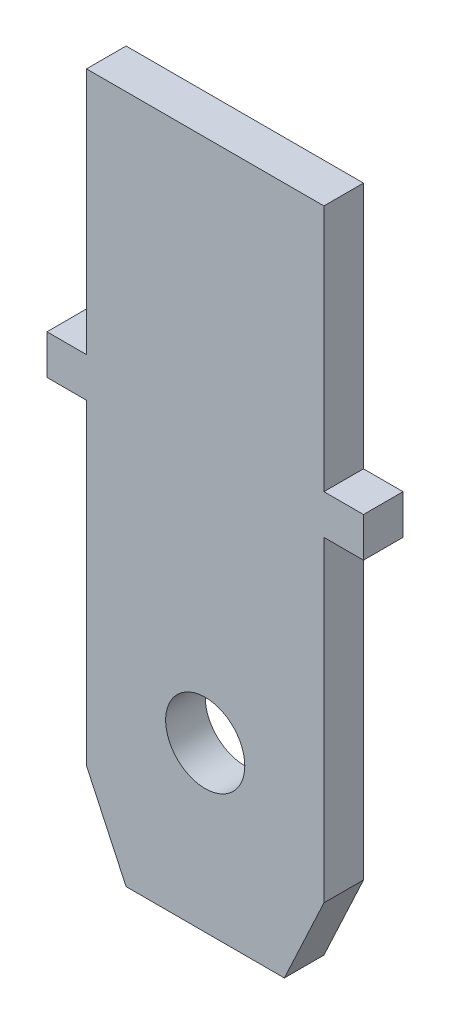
ISO-10303-21;
HEADER;
FILE_DESCRIPTION(('STEP AP214'),'2;1');
FILE_NAME('part.step','',(''),(''),'','','');
FILE_SCHEMA(('AUTOMOTIVE_DESIGN { 1 0 10303 214 1 1 1 1 }'));
ENDSEC;
DATA;
#1=APPLICATION_CONTEXT('core data for automotive mechanical design processes');
#2=APPLICATION_PROTOCOL_DEFINITION('international standard','automotive_design',2000,#1);
#3=PRODUCT_CONTEXT('',#1,'mechanical');
#4=PRODUCT('Part','Part','',(#3));
#5=PRODUCT_RELATED_PRODUCT_CATEGORY('part','',(#4));
#6=PRODUCT_DEFINITION_FORMATION('','',#4);
#7=PRODUCT_DEFINITION_CONTEXT('part definition',#1,'design');
#8=PRODUCT_DEFINITION('design','',#6,#7);
#9=PRODUCT_DEFINITION_SHAPE('','',#8);
#10=(LENGTH_UNIT() NAMED_UNIT(*) SI_UNIT(.MILLI.,.METRE.));
#11=(NAMED_UNIT(*) PLANE_ANGLE_UNIT() SI_UNIT($,.RADIAN.));
#12=(NAMED_UNIT(*) SI_UNIT($,.STERADIAN.) SOLID_ANGLE_UNIT());
#13=UNCERTAINTY_MEASURE_WITH_UNIT(LENGTH_MEASURE(1.E-05),#10,'distance_accuracy_value','');
#14=(GEOMETRIC_REPRESENTATION_CONTEXT(3) GLOBAL_UNCERTAINTY_ASSIGNED_CONTEXT((#13)) GLOBAL_UNIT_ASSIGNED_CONTEXT((#10,
#11,#12)) REPRESENTATION_CONTEXT('',''));
#15=CARTESIAN_POINT('',(0.,0.,0.));
#16=DIRECTION('',(0.,0.,1.));
#17=DIRECTION('',(1.,0.,0.));
#18=AXIS2_PLACEMENT_3D('',#15,#16,#17);
#19=CARTESIAN_POINT('',(0.,0.,1.));
#20=DIRECTION('',(0.,0.,-1.));
#21=DIRECTION('',(-1.,0.,0.));
#22=AXIS2_PLACEMENT_3D('',#19,#20,#21);
#23=PLANE('',#22);
#24=DIRECTION('',(1.,0.,0.));
#25=VECTOR('',#24,1.);
#26=CARTESIAN_POINT('',(1.,0.,1.));
#27=LINE('',#26,#25);
#28=CARTESIAN_POINT('',(0.,0.,1.));
#29=VERTEX_POINT('',#28);
#30=CARTESIAN_POINT('',(1.,0.,1.));
#31=VERTEX_POINT('',#30);
#32=EDGE_CURVE('E192',#29,#31,#27,.T.);
#33=ORIENTED_EDGE('',*,*,#32,.T.);
#34=DIRECTION('',(0.,-1.,0.));
#35=VECTOR('',#34,1.);
#36=CARTESIAN_POINT('',(1.,-8.,1.));
#37=LINE('',#36,#35);
#38=CARTESIAN_POINT('',(1.,-8.,1.));
#39=VERTEX_POINT('',#38);
#40=EDGE_CURVE('E110',#31,#39,#37,.T.);
#41=ORIENTED_EDGE('',*,*,#40,.T.);
#42=DIRECTION('',(0.422618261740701,-0.906307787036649,0.));
#43=VECTOR('',#42,1.);
#44=CARTESIAN_POINT('',(2.,-10.1445069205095,1.));
#45=LINE('',#44,#43);
#46=CARTESIAN_POINT('',(2.,-10.1445069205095,1.));
#47=VERTEX_POINT('',#46);
#48=EDGE_CURVE('E225',#39,#47,#45,.T.);
#49=ORIENTED_EDGE('',*,*,#48,.T.);
#50=DIRECTION('',(1.,0.,0.));
#51=VECTOR('',#50,1.);
#52=CARTESIAN_POINT('',(6.,-10.1445069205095,1.));
#53=LINE('',#52,#51);
#54=CARTESIAN_POINT('',(6.,-10.1445069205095,1.));
#55=VERTEX_POINT('',#54);
#56=EDGE_CURVE('E244',#47,#55,#53,.T.);
#57=ORIENTED_EDGE('',*,*,#56,.T.);
#58=DIRECTION('',(0.422618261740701,0.906307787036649,0.));
#59=VECTOR('',#58,1.);
#60=CARTESIAN_POINT('',(7.,-8.,1.));
#61=LINE('',#60,#59);
#62=CARTESIAN_POINT('',(7.,-8.,1.));
#63=VERTEX_POINT('',#62);
#64=EDGE_CURVE('E241',#55,#63,#61,.T.);
#65=ORIENTED_EDGE('',*,*,#64,.T.);
#66=DIRECTION('',(0.,1.,0.));
#67=VECTOR('',#66,1.);
#68=CARTESIAN_POINT('',(7.,0.,1.));
#69=LINE('',#68,#67);
#70=CARTESIAN_POINT('',(7.,0.,1.));
#71=VERTEX_POINT('',#70);
#72=EDGE_CURVE('E243',#63,#71,#69,.T.);
#73=ORIENTED_EDGE('',*,*,#72,.T.);
#74=DIRECTION('',(1.,0.,0.));
#75=VECTOR('',#74,1.);
#76=CARTESIAN_POINT('',(8.,0.,1.));
#77=LINE('',#76,#75);
#78=CARTESIAN_POINT('',(8.,0.,1.));
#79=VERTEX_POINT('',#78);
#80=EDGE_CURVE('E246',#71,#79,#77,.T.);
#81=ORIENTED_EDGE('',*,*,#80,.T.);
#82=DIRECTION('',(0.,1.,0.));
#83=VECTOR('',#82,1.);
#84=CARTESIAN_POINT('',(8.,0.999999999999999,1.));
#85=LINE('',#84,#83);
#86=CARTESIAN_POINT('',(8.,0.999999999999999,1.));
#87=VERTEX_POINT('',#86);
#88=EDGE_CURVE('E252',#79,#87,#85,.T.);
#89=ORIENTED_EDGE('',*,*,#88,.T.);
#90=DIRECTION('',(-1.,0.,0.));
#91=VECTOR('',#90,1.);
#92=CARTESIAN_POINT('',(7.,0.999999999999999,1.));
#93=LINE('',#92,#91);
#94=CARTESIAN_POINT('',(7.,0.999999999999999,1.));
#95=VERTEX_POINT('',#94);
#96=EDGE_CURVE('E254',#87,#95,#93,.T.);
#97=ORIENTED_EDGE('',*,*,#96,.T.);
#98=DIRECTION('',(0.,1.,0.));
#99=VECTOR('',#98,1.);
#100=CARTESIAN_POINT('',(7.,7.25470149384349,1.));
#101=LINE('',#100,#99);
#102=CARTESIAN_POINT('',(7.,7.25470149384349,1.));
#103=VERTEX_POINT('',#102);
#104=EDGE_CURVE('E256',#95,#103,#101,.T.);
#105=ORIENTED_EDGE('',*,*,#104,.T.);
#106=DIRECTION('',(-1.,0.,0.));
#107=VECTOR('',#106,1.);
#108=CARTESIAN_POINT('',(1.,7.25470149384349,1.));
#109=LINE('',#108,#107);
#110=CARTESIAN_POINT('',(1.,7.25470149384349,1.));
#111=VERTEX_POINT('',#110);
#112=EDGE_CURVE('E147',#103,#111,#109,.T.);
#113=ORIENTED_EDGE('',*,*,#112,.T.);
#114=DIRECTION('',(0.,-1.,0.));
#115=VECTOR('',#114,1.);
#116=CARTESIAN_POINT('',(1.,1.,1.));
#117=LINE('',#116,#115);
#118=CARTESIAN_POINT('',(1.,1.,1.));
#119=VERTEX_POINT('',#118);
#120=EDGE_CURVE('E141',#111,#119,#117,.T.);
#121=ORIENTED_EDGE('',*,*,#120,.T.);
#122=DIRECTION('',(-1.,0.,0.));
#123=VECTOR('',#122,1.);
#124=CARTESIAN_POINT('',(0.,0.999999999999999,1.));
#125=LINE('',#124,#123);
#126=CARTESIAN_POINT('',(0.,0.999999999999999,1.));
#127=VERTEX_POINT('',#126);
#128=EDGE_CURVE('E145',#119,#127,#125,.T.);
#129=ORIENTED_EDGE('',*,*,#128,.T.);
#130=DIRECTION('',(0.,-1.,0.));
#131=VECTOR('',#130,1.);
#132=CARTESIAN_POINT('',(0.,0.,1.));
#133=LINE('',#132,#131);
#134=EDGE_CURVE('E49',#127,#29,#133,.T.);
#135=ORIENTED_EDGE('',*,*,#134,.T.);
#136=EDGE_LOOP('',(#33,#41,#49,#57,#65,#73,#81,#89,#97,#105,#113,#121,#129,#135));
#137=FACE_BOUND('',#136,.T.);
#138=CARTESIAN_POINT('',(4.,-6.,1.));
#139=DIRECTION('',(0.,0.,1.));
#140=DIRECTION('',(1.,0.,0.));
#141=AXIS2_PLACEMENT_3D('',#138,#139,#140);
#142=CIRCLE('',#141,1.);
#143=CARTESIAN_POINT('',(5.,-6.,1.));
#144=VERTEX_POINT('',#143);
#145=EDGE_CURVE('E169',#144,#144,#142,.T.);
#146=ORIENTED_EDGE('',*,*,#145,.F.);
#147=EDGE_LOOP('',(#146));
#148=FACE_BOUND('',#147,.T.);
#149=ADVANCED_FACE('F32',(#137,#148),#23,.F.);
#150=CARTESIAN_POINT('',(0.,0.,0.));
#151=DIRECTION('',(0.,0.,-1.));
#152=DIRECTION('',(-1.,0.,0.));
#153=AXIS2_PLACEMENT_3D('',#150,#151,#152);
#154=PLANE('',#153);
#155=DIRECTION('',(1.,0.,0.));
#156=VECTOR('',#155,1.);
#157=CARTESIAN_POINT('',(1.,0.,0.));
#158=LINE('',#157,#156);
#159=CARTESIAN_POINT('',(0.,0.,0.));
#160=VERTEX_POINT('',#159);
#161=CARTESIAN_POINT('',(1.,0.,0.));
#162=VERTEX_POINT('',#161);
#163=EDGE_CURVE('E165',#160,#162,#158,.T.);
#164=ORIENTED_EDGE('',*,*,#163,.F.);
#165=DIRECTION('',(0.,-1.,0.));
#166=VECTOR('',#165,1.);
#167=CARTESIAN_POINT('',(0.,0.,0.));
#168=LINE('',#167,#166);
#169=CARTESIAN_POINT('',(0.,0.999999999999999,0.));
#170=VERTEX_POINT('',#169);
#171=EDGE_CURVE('E102',#170,#160,#168,.T.);
#172=ORIENTED_EDGE('',*,*,#171,.F.);
#173=DIRECTION('',(-1.,0.,0.));
#174=VECTOR('',#173,1.);
#175=CARTESIAN_POINT('',(0.,0.999999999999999,0.));
#176=LINE('',#175,#174);
#177=CARTESIAN_POINT('',(1.,1.,0.));
#178=VERTEX_POINT('',#177);
#179=EDGE_CURVE('E96',#178,#170,#176,.T.);
#180=ORIENTED_EDGE('',*,*,#179,.F.);
#181=DIRECTION('',(0.,-1.,0.));
#182=VECTOR('',#181,1.);
#183=CARTESIAN_POINT('',(1.,1.,0.));
#184=LINE('',#183,#182);
#185=CARTESIAN_POINT('',(1.,7.25470149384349,0.));
#186=VERTEX_POINT('',#185);
#187=EDGE_CURVE('E155',#186,#178,#184,.T.);
#188=ORIENTED_EDGE('',*,*,#187,.F.);
#189=DIRECTION('',(-1.,0.,0.));
#190=VECTOR('',#189,1.);
#191=CARTESIAN_POINT('',(1.,7.25470149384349,0.));
#192=LINE('',#191,#190);
#193=CARTESIAN_POINT('',(7.,7.25470149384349,0.));
#194=VERTEX_POINT('',#193);
#195=EDGE_CURVE('E187',#194,#186,#192,.T.);
#196=ORIENTED_EDGE('',*,*,#195,.F.);
#197=DIRECTION('',(0.,1.,0.));
#198=VECTOR('',#197,1.);
#199=CARTESIAN_POINT('',(7.,7.25470149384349,0.));
#200=LINE('',#199,#198);
#201=CARTESIAN_POINT('',(7.,0.999999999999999,0.));
#202=VERTEX_POINT('',#201);
#203=EDGE_CURVE('E185',#202,#194,#200,.T.);
#204=ORIENTED_EDGE('',*,*,#203,.F.);
#205=DIRECTION('',(-1.,0.,0.));
#206=VECTOR('',#205,1.);
#207=CARTESIAN_POINT('',(7.,0.999999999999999,0.));
#208=LINE('',#207,#206);
#209=CARTESIAN_POINT('',(8.,0.999999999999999,0.));
#210=VERTEX_POINT('',#209);
#211=EDGE_CURVE('E183',#210,#202,#208,.T.);
#212=ORIENTED_EDGE('',*,*,#211,.F.);
#213=DIRECTION('',(0.,1.,0.));
#214=VECTOR('',#213,1.);
#215=CARTESIAN_POINT('',(8.,0.999999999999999,0.));
#216=LINE('',#215,#214);
#217=CARTESIAN_POINT('',(8.,0.,0.));
#218=VERTEX_POINT('',#217);
#219=EDGE_CURVE('E181',#218,#210,#216,.T.);
#220=ORIENTED_EDGE('',*,*,#219,.F.);
#221=DIRECTION('',(1.,0.,0.));
#222=VECTOR('',#221,1.);
#223=CARTESIAN_POINT('',(8.,0.,0.));
#224=LINE('',#223,#222);
#225=CARTESIAN_POINT('',(7.,0.,0.));
#226=VERTEX_POINT('',#225);
#227=EDGE_CURVE('E179',#226,#218,#224,.T.);
#228=ORIENTED_EDGE('',*,*,#227,.F.);
#229=DIRECTION('',(0.,1.,0.));
#230=VECTOR('',#229,1.);
#231=CARTESIAN_POINT('',(7.,0.,0.));
#232=LINE('',#231,#230);
#233=CARTESIAN_POINT('',(7.,-8.,0.));
#234=VERTEX_POINT('',#233);
#235=EDGE_CURVE('E177',#234,#226,#232,.T.);
#236=ORIENTED_EDGE('',*,*,#235,.F.);
#237=DIRECTION('',(0.422618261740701,0.906307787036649,0.));
#238=VECTOR('',#237,1.);
#239=CARTESIAN_POINT('',(7.,-8.,0.));
#240=LINE('',#239,#238);
#241=CARTESIAN_POINT('',(6.,-10.1445069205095,0.));
#242=VERTEX_POINT('',#241);
#243=EDGE_CURVE('E175',#242,#234,#240,.T.);
#244=ORIENTED_EDGE('',*,*,#243,.F.);
#245=DIRECTION('',(1.,0.,0.));
#246=VECTOR('',#245,1.);
#247=CARTESIAN_POINT('',(6.,-10.1445069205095,0.));
#248=LINE('',#247,#246);
#249=CARTESIAN_POINT('',(2.,-10.1445069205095,0.));
#250=VERTEX_POINT('',#249);
#251=EDGE_CURVE('E173',#250,#242,#248,.T.);
#252=ORIENTED_EDGE('',*,*,#251,.F.);
#253=DIRECTION('',(0.422618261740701,-0.906307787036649,0.));
#254=VECTOR('',#253,1.);
#255=CARTESIAN_POINT('',(2.,-10.1445069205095,0.));
#256=LINE('',#255,#254);
#257=CARTESIAN_POINT('',(1.,-8.,0.));
#258=VERTEX_POINT('',#257);
#259=EDGE_CURVE('E171',#258,#250,#256,.T.);
#260=ORIENTED_EDGE('',*,*,#259,.F.);
#261=DIRECTION('',(0.,-1.,0.));
#262=VECTOR('',#261,1.);
#263=CARTESIAN_POINT('',(1.,-8.,0.));
#264=LINE('',#263,#262);
#265=EDGE_CURVE('E168',#162,#258,#264,.T.);
#266=ORIENTED_EDGE('',*,*,#265,.F.);
#267=EDGE_LOOP('',(#164,#172,#180,#188,#196,#204,#212,#220,#228,#236,#244,#252,#260,#266));
#268=FACE_BOUND('',#267,.T.);
#269=CARTESIAN_POINT('',(4.,-6.,0.));
#270=DIRECTION('',(0.,0.,1.));
#271=DIRECTION('',(1.,0.,0.));
#272=AXIS2_PLACEMENT_3D('',#269,#270,#271);
#273=CIRCLE('',#272,1.);
#274=CARTESIAN_POINT('',(5.,-6.,0.));
#275=VERTEX_POINT('',#274);
#276=EDGE_CURVE('E429',#275,#275,#273,.T.);
#277=ORIENTED_EDGE('',*,*,#276,.T.);
#278=EDGE_LOOP('',(#277));
#279=FACE_BOUND('',#278,.T.);
#280=ADVANCED_FACE('F229',(#268,#279),#154,.T.);
#281=CARTESIAN_POINT('',(1.,0.,1.));
#282=DIRECTION('',(0.,1.,0.));
#283=DIRECTION('',(-1.,0.,0.));
#284=AXIS2_PLACEMENT_3D('',#281,#282,#283);
#285=PLANE('',#284);
#286=ORIENTED_EDGE('',*,*,#163,.T.);
#287=DIRECTION('',(0.,0.,-1.));
#288=VECTOR('',#287,1.);
#289=CARTESIAN_POINT('',(1.,0.,1.));
#290=LINE('',#289,#288);
#291=EDGE_CURVE('E11',#31,#162,#290,.T.);
#292=ORIENTED_EDGE('',*,*,#291,.F.);
#293=ORIENTED_EDGE('',*,*,#32,.F.);
#294=DIRECTION('',(0.,0.,-1.));
#295=VECTOR('',#294,1.);
#296=CARTESIAN_POINT('',(0.,0.,1.));
#297=LINE('',#296,#295);
#298=EDGE_CURVE('E161',#29,#160,#297,.T.);
#299=ORIENTED_EDGE('',*,*,#298,.T.);
#300=EDGE_LOOP('',(#286,#292,#293,#299));
#301=FACE_BOUND('',#300,.T.);
#302=ADVANCED_FACE('F34',(#301),#285,.F.);
#303=CARTESIAN_POINT('',(1.,-8.,1.));
#304=DIRECTION('',(1.,0.,0.));
#305=DIRECTION('',(0.,0.,-1.));
#306=AXIS2_PLACEMENT_3D('',#303,#304,#305);
#307=PLANE('',#306);
#308=ORIENTED_EDGE('',*,*,#265,.T.);
#309=DIRECTION('',(0.,0.,-1.));
#310=VECTOR('',#309,1.);
#311=CARTESIAN_POINT('',(1.,-8.,1.));
#312=LINE('',#311,#310);
#313=EDGE_CURVE('E41',#39,#258,#312,.T.);
#314=ORIENTED_EDGE('',*,*,#313,.F.);
#315=ORIENTED_EDGE('',*,*,#40,.F.);
#316=ORIENTED_EDGE('',*,*,#291,.T.);
#317=EDGE_LOOP('',(#308,#314,#315,#316));
#318=FACE_BOUND('',#317,.T.);
#319=ADVANCED_FACE('F290',(#318),#307,.F.);
#320=CARTESIAN_POINT('',(2.,-10.1445069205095,1.));
#321=DIRECTION('',(0.906307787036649,0.422618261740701,0.));
#322=DIRECTION('',(-0.422618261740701,0.906307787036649,0.));
#323=AXIS2_PLACEMENT_3D('',#320,#321,#322);
#324=PLANE('',#323);
#325=ORIENTED_EDGE('',*,*,#259,.T.);
#326=DIRECTION('',(0.,0.,-1.));
#327=VECTOR('',#326,1.);
#328=CARTESIAN_POINT('',(2.,-10.1445069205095,1.));
#329=LINE('',#328,#327);
#330=EDGE_CURVE('E217',#47,#250,#329,.T.);
#331=ORIENTED_EDGE('',*,*,#330,.F.);
#332=ORIENTED_EDGE('',*,*,#48,.F.);
#333=ORIENTED_EDGE('',*,*,#313,.T.);
#334=EDGE_LOOP('',(#325,#331,#332,#333));
#335=FACE_BOUND('',#334,.T.);
#336=ADVANCED_FACE('F223',(#335),#324,.F.);
#337=CARTESIAN_POINT('',(6.,-10.1445069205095,1.));
#338=DIRECTION('',(0.,1.,0.));
#339=DIRECTION('',(0.,0.,1.));
#340=AXIS2_PLACEMENT_3D('',#337,#338,#339);
#341=PLANE('',#340);
#342=ORIENTED_EDGE('',*,*,#251,.T.);
#343=DIRECTION('',(0.,0.,-1.));
#344=VECTOR('',#343,1.);
#345=CARTESIAN_POINT('',(6.,-10.1445069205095,1.));
#346=LINE('',#345,#344);
#347=EDGE_CURVE('E214',#55,#242,#346,.T.);
#348=ORIENTED_EDGE('',*,*,#347,.F.);
#349=ORIENTED_EDGE('',*,*,#56,.F.);
#350=ORIENTED_EDGE('',*,*,#330,.T.);
#351=EDGE_LOOP('',(#342,#348,#349,#350));
#352=FACE_BOUND('',#351,.T.);
#353=ADVANCED_FACE('F235',(#352),#341,.F.);
#354=CARTESIAN_POINT('',(7.,-8.,1.));
#355=DIRECTION('',(-0.906307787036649,0.422618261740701,0.));
#356=DIRECTION('',(-0.422618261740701,-0.906307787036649,0.));
#357=AXIS2_PLACEMENT_3D('',#354,#355,#356);
#358=PLANE('',#357);
#359=ORIENTED_EDGE('',*,*,#243,.T.);
#360=DIRECTION('',(0.,0.,-1.));
#361=VECTOR('',#360,1.);
#362=CARTESIAN_POINT('',(7.,-8.,1.));
#363=LINE('',#362,#361);
#364=EDGE_CURVE('E211',#63,#234,#363,.T.);
#365=ORIENTED_EDGE('',*,*,#364,.F.);
#366=ORIENTED_EDGE('',*,*,#64,.F.);
#367=ORIENTED_EDGE('',*,*,#347,.T.);
#368=EDGE_LOOP('',(#359,#365,#366,#367));
#369=FACE_BOUND('',#368,.T.);
#370=ADVANCED_FACE('F239',(#369),#358,.F.);
#371=CARTESIAN_POINT('',(7.,0.,1.));
#372=DIRECTION('',(-1.,0.,0.));
#373=DIRECTION('',(0.,-1.,0.));
#374=AXIS2_PLACEMENT_3D('',#371,#372,#373);
#375=PLANE('',#374);
#376=ORIENTED_EDGE('',*,*,#235,.T.);
#377=DIRECTION('',(0.,0.,-1.));
#378=VECTOR('',#377,1.);
#379=CARTESIAN_POINT('',(7.,0.,1.));
#380=LINE('',#379,#378);
#381=EDGE_CURVE('E208',#71,#226,#380,.T.);
#382=ORIENTED_EDGE('',*,*,#381,.F.);
#383=ORIENTED_EDGE('',*,*,#72,.F.);
#384=ORIENTED_EDGE('',*,*,#364,.T.);
#385=EDGE_LOOP('',(#376,#382,#383,#384));
#386=FACE_BOUND('',#385,.T.);
#387=ADVANCED_FACE('F303',(#386),#375,.F.);
#388=CARTESIAN_POINT('',(8.,0.,1.));
#389=DIRECTION('',(0.,1.,0.));
#390=DIRECTION('',(-1.,0.,0.));
#391=AXIS2_PLACEMENT_3D('',#388,#389,#390);
#392=PLANE('',#391);
#393=ORIENTED_EDGE('',*,*,#227,.T.);
#394=DIRECTION('',(0.,0.,-1.));
#395=VECTOR('',#394,1.);
#396=CARTESIAN_POINT('',(8.,0.,1.));
#397=LINE('',#396,#395);
#398=EDGE_CURVE('E205',#79,#218,#397,.T.);
#399=ORIENTED_EDGE('',*,*,#398,.F.);
#400=ORIENTED_EDGE('',*,*,#80,.F.);
#401=ORIENTED_EDGE('',*,*,#381,.T.);
#402=EDGE_LOOP('',(#393,#399,#400,#401));
#403=FACE_BOUND('',#402,.T.);
#404=ADVANCED_FACE('F306',(#403),#392,.F.);
#405=CARTESIAN_POINT('',(8.,0.999999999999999,1.));
#406=DIRECTION('',(-1.,0.,0.));
#407=DIRECTION('',(0.,0.,1.));
#408=AXIS2_PLACEMENT_3D('',#405,#406,#407);
#409=PLANE('',#408);
#410=ORIENTED_EDGE('',*,*,#219,.T.);
#411=DIRECTION('',(0.,0.,-1.));
#412=VECTOR('',#411,1.);
#413=CARTESIAN_POINT('',(8.,0.999999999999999,1.));
#414=LINE('',#413,#412);
#415=EDGE_CURVE('E202',#87,#210,#414,.T.);
#416=ORIENTED_EDGE('',*,*,#415,.F.);
#417=ORIENTED_EDGE('',*,*,#88,.F.);
#418=ORIENTED_EDGE('',*,*,#398,.T.);
#419=EDGE_LOOP('',(#410,#416,#417,#418));
#420=FACE_BOUND('',#419,.T.);
#421=ADVANCED_FACE('F310',(#420),#409,.F.);
#422=CARTESIAN_POINT('',(7.,0.999999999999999,1.));
#423=DIRECTION('',(0.,-1.,0.));
#424=DIRECTION('',(0.,0.,-1.));
#425=AXIS2_PLACEMENT_3D('',#422,#423,#424);
#426=PLANE('',#425);
#427=ORIENTED_EDGE('',*,*,#211,.T.);
#428=DIRECTION('',(0.,0.,-1.));
#429=VECTOR('',#428,1.);
#430=CARTESIAN_POINT('',(7.,0.999999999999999,1.));
#431=LINE('',#430,#429);
#432=EDGE_CURVE('E199',#95,#202,#431,.T.);
#433=ORIENTED_EDGE('',*,*,#432,.F.);
#434=ORIENTED_EDGE('',*,*,#96,.F.);
#435=ORIENTED_EDGE('',*,*,#415,.T.);
#436=EDGE_LOOP('',(#427,#433,#434,#435));
#437=FACE_BOUND('',#436,.T.);
#438=ADVANCED_FACE('F314',(#437),#426,.F.);
#439=CARTESIAN_POINT('',(7.,7.25470149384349,1.));
#440=DIRECTION('',(-1.,0.,0.));
#441=DIRECTION('',(0.,-1.,0.));
#442=AXIS2_PLACEMENT_3D('',#439,#440,#441);
#443=PLANE('',#442);
#444=ORIENTED_EDGE('',*,*,#203,.T.);
#445=DIRECTION('',(0.,0.,-1.));
#446=VECTOR('',#445,1.);
#447=CARTESIAN_POINT('',(7.,7.25470149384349,1.));
#448=LINE('',#447,#446);
#449=EDGE_CURVE('E196',#103,#194,#448,.T.);
#450=ORIENTED_EDGE('',*,*,#449,.F.);
#451=ORIENTED_EDGE('',*,*,#104,.F.);
#452=ORIENTED_EDGE('',*,*,#432,.T.);
#453=EDGE_LOOP('',(#444,#450,#451,#452));
#454=FACE_BOUND('',#453,.T.);
#455=ADVANCED_FACE('F262',(#454),#443,.F.);
#456=CARTESIAN_POINT('',(1.,7.25470149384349,1.));
#457=DIRECTION('',(0.,-1.,0.));
#458=DIRECTION('',(0.,0.,-1.));
#459=AXIS2_PLACEMENT_3D('',#456,#457,#458);
#460=PLANE('',#459);
#461=ORIENTED_EDGE('',*,*,#195,.T.);
#462=DIRECTION('',(0.,0.,-1.));
#463=VECTOR('',#462,1.);
#464=CARTESIAN_POINT('',(1.,7.25470149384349,1.));
#465=LINE('',#464,#463);
#466=EDGE_CURVE('E156',#111,#186,#465,.T.);
#467=ORIENTED_EDGE('',*,*,#466,.F.);
#468=ORIENTED_EDGE('',*,*,#112,.F.);
#469=ORIENTED_EDGE('',*,*,#449,.T.);
#470=EDGE_LOOP('',(#461,#467,#468,#469));
#471=FACE_BOUND('',#470,.T.);
#472=ADVANCED_FACE('F266',(#471),#460,.F.);
#473=CARTESIAN_POINT('',(1.,1.,1.));
#474=DIRECTION('',(1.,0.,0.));
#475=DIRECTION('',(0.,0.,-1.));
#476=AXIS2_PLACEMENT_3D('',#473,#474,#475);
#477=PLANE('',#476);
#478=ORIENTED_EDGE('',*,*,#187,.T.);
#479=DIRECTION('',(0.,0.,-1.));
#480=VECTOR('',#479,1.);
#481=CARTESIAN_POINT('',(1.,1.,1.));
#482=LINE('',#481,#480);
#483=EDGE_CURVE('E152',#119,#178,#482,.T.);
#484=ORIENTED_EDGE('',*,*,#483,.F.);
#485=ORIENTED_EDGE('',*,*,#120,.F.);
#486=ORIENTED_EDGE('',*,*,#466,.T.);
#487=EDGE_LOOP('',(#478,#484,#485,#486));
#488=FACE_BOUND('',#487,.T.);
#489=ADVANCED_FACE('F153',(#488),#477,.F.);
#490=CARTESIAN_POINT('',(0.,0.999999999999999,1.));
#491=DIRECTION('',(0.,-1.,0.));
#492=DIRECTION('',(1.,0.,0.));
#493=AXIS2_PLACEMENT_3D('',#490,#491,#492);
#494=PLANE('',#493);
#495=ORIENTED_EDGE('',*,*,#179,.T.);
#496=DIRECTION('',(0.,0.,-1.));
#497=VECTOR('',#496,1.);
#498=CARTESIAN_POINT('',(0.,0.999999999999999,1.));
#499=LINE('',#498,#497);
#500=EDGE_CURVE('E157',#127,#170,#499,.T.);
#501=ORIENTED_EDGE('',*,*,#500,.F.);
#502=ORIENTED_EDGE('',*,*,#128,.F.);
#503=ORIENTED_EDGE('',*,*,#483,.T.);
#504=EDGE_LOOP('',(#495,#501,#502,#503));
#505=FACE_BOUND('',#504,.T.);
#506=ADVANCED_FACE('F159',(#505),#494,.F.);
#507=CARTESIAN_POINT('',(0.,0.,1.));
#508=DIRECTION('',(1.,0.,0.));
#509=DIRECTION('',(0.,0.,-1.));
#510=AXIS2_PLACEMENT_3D('',#507,#508,#509);
#511=PLANE('',#510);
#512=ORIENTED_EDGE('',*,*,#171,.T.);
#513=ORIENTED_EDGE('',*,*,#298,.F.);
#514=ORIENTED_EDGE('',*,*,#134,.F.);
#515=ORIENTED_EDGE('',*,*,#500,.T.);
#516=EDGE_LOOP('',(#512,#513,#514,#515));
#517=FACE_BOUND('',#516,.T.);
#518=ADVANCED_FACE('F270',(#517),#511,.F.);
#519=CARTESIAN_POINT('',(4.,-6.,1.));
#520=DIRECTION('',(0.,0.,-1.));
#521=DIRECTION('',(-1.,0.,0.));
#522=AXIS2_PLACEMENT_3D('',#519,#520,#521);
#523=CYLINDRICAL_SURFACE('',#522,1.);
#524=ORIENTED_EDGE('',*,*,#145,.T.);
#525=EDGE_LOOP('',(#524));
#526=FACE_BOUND('',#525,.T.);
#527=ORIENTED_EDGE('',*,*,#276,.F.);
#528=EDGE_LOOP('',(#527));
#529=FACE_BOUND('',#528,.T.);
#530=ADVANCED_FACE('F272',(#526,#529),#523,.F.);
#531=CLOSED_SHELL('',(#149,#280,#302,#319,#336,#353,#370,#387,#404,#421,#438,#455,#472,#489,
#506,#518,#530));
#532=MANIFOLD_SOLID_BREP('B2',#531);
#533=ADVANCED_BREP_SHAPE_REPRESENTATION('',(#18,#532),#14);
#534=SHAPE_DEFINITION_REPRESENTATION(#9,#533);
ENDSEC;
END-ISO-10303-21;
